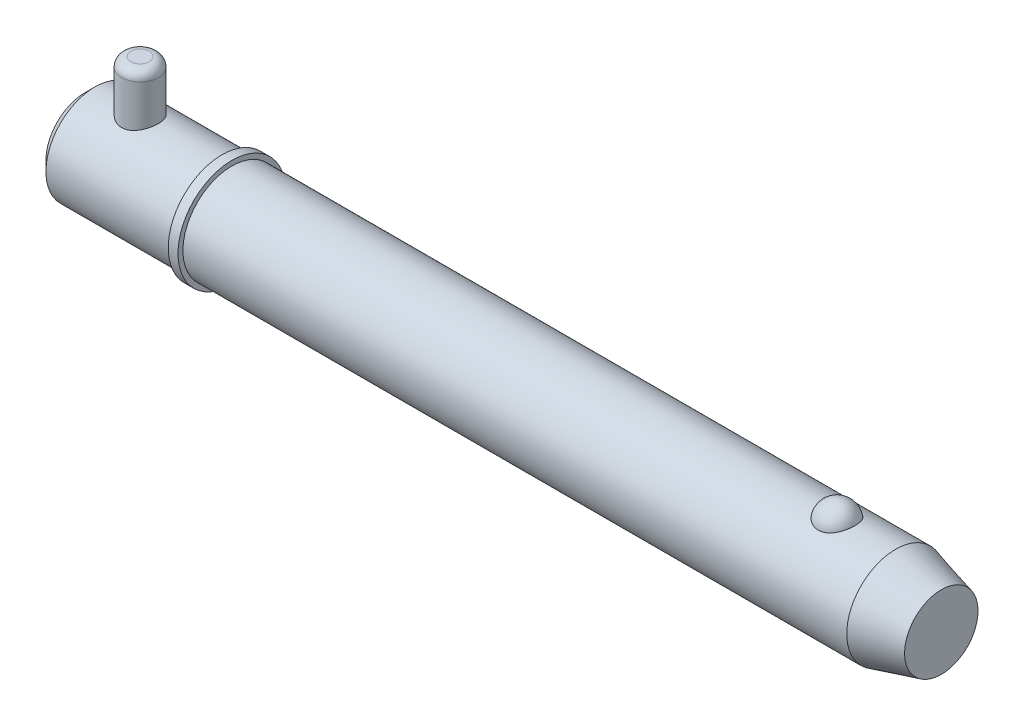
ISO-10303-21;
HEADER;
FILE_DESCRIPTION(('STEP AP214'),'2;1');
FILE_NAME('part.step','',(''),(''),'','','');
FILE_SCHEMA(('AUTOMOTIVE_DESIGN { 1 0 10303 214 1 1 1 1 }'));
ENDSEC;
DATA;
#1=APPLICATION_CONTEXT('core data for automotive mechanical design processes');
#2=APPLICATION_PROTOCOL_DEFINITION('international standard','automotive_design',2000,#1);
#3=PRODUCT_CONTEXT('',#1,'mechanical');
#4=PRODUCT('Part','Part','',(#3));
#5=PRODUCT_RELATED_PRODUCT_CATEGORY('part','',(#4));
#6=PRODUCT_DEFINITION_FORMATION('','',#4);
#7=PRODUCT_DEFINITION_CONTEXT('part definition',#1,'design');
#8=PRODUCT_DEFINITION('design','',#6,#7);
#9=PRODUCT_DEFINITION_SHAPE('','',#8);
#10=(LENGTH_UNIT() NAMED_UNIT(*) SI_UNIT(.MILLI.,.METRE.));
#11=(NAMED_UNIT(*) PLANE_ANGLE_UNIT() SI_UNIT($,.RADIAN.));
#12=(NAMED_UNIT(*) SI_UNIT($,.STERADIAN.) SOLID_ANGLE_UNIT());
#13=UNCERTAINTY_MEASURE_WITH_UNIT(LENGTH_MEASURE(1.E-05),#10,'distance_accuracy_value','');
#14=(GEOMETRIC_REPRESENTATION_CONTEXT(3) GLOBAL_UNCERTAINTY_ASSIGNED_CONTEXT((#13)) GLOBAL_UNIT_ASSIGNED_CONTEXT((#10,
#11,#12)) REPRESENTATION_CONTEXT('',''));
#15=CARTESIAN_POINT('',(0.,0.,0.));
#16=DIRECTION('',(0.,0.,1.));
#17=DIRECTION('',(1.,0.,0.));
#18=AXIS2_PLACEMENT_3D('',#15,#16,#17);
#19=CARTESIAN_POINT('',(14.28,25.4,0.));
#20=DIRECTION('',(0.,-1.,0.));
#21=DIRECTION('',(0.,0.,-1.));
#22=AXIS2_PLACEMENT_3D('',#19,#20,#21);
#23=CYLINDRICAL_SURFACE('',#22,4.76);
#24=CARTESIAN_POINT('',(14.28,-10.32,0.));
#25=DIRECTION('',(0.,1.,0.));
#26=DIRECTION('',(0.,0.,1.));
#27=AXIS2_PLACEMENT_3D('',#24,#25,#26);
#28=CIRCLE('',#27,4.76);
#29=CARTESIAN_POINT('',(14.28,-10.32,-4.76));
#30=VERTEX_POINT('',#29);
#31=EDGE_CURVE('P0_E25',#30,#30,#28,.T.);
#32=CARTESIAN_POINT('',(14.28,23.02,0.));
#33=DIRECTION('',(0.,1.,0.));
#34=DIRECTION('',(0.,0.,1.));
#35=AXIS2_PLACEMENT_3D('',#32,#33,#34);
#36=CIRCLE('',#35,4.76);
#37=CARTESIAN_POINT('',(14.28,23.02,-4.76));
#38=VERTEX_POINT('',#37);
#39=EDGE_CURVE('P0_E29',#38,#38,#36,.F.);
#40=CARTESIAN_POINT('',(14.28,-10.32,-4.76));
#41=CARTESIAN_POINT('',(14.28,-9.97270833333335,-4.76));
#42=CARTESIAN_POINT('',(14.28,-9.62541666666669,-4.76));
#43=CARTESIAN_POINT('',(14.28,-8.93083333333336,-4.76));
#44=CARTESIAN_POINT('',(14.28,-8.58354166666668,-4.76));
#45=CARTESIAN_POINT('',(14.28,-7.88895833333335,-4.76));
#46=CARTESIAN_POINT('',(14.28,-7.54166666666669,-4.76));
#47=CARTESIAN_POINT('',(14.28,-6.84708333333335,-4.76));
#48=CARTESIAN_POINT('',(14.28,-6.49979166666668,-4.76));
#49=CARTESIAN_POINT('',(14.28,-5.80520833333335,-4.76));
#50=CARTESIAN_POINT('',(14.28,-5.45791666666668,-4.76));
#51=CARTESIAN_POINT('',(14.28,-4.76333333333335,-4.76));
#52=CARTESIAN_POINT('',(14.28,-4.41604166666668,-4.76));
#53=CARTESIAN_POINT('',(14.28,-3.72145833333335,-4.76));
#54=CARTESIAN_POINT('',(14.28,-3.37416666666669,-4.76));
#55=CARTESIAN_POINT('',(14.28,-2.67958333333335,-4.76));
#56=CARTESIAN_POINT('',(14.28,-2.33229166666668,-4.76));
#57=CARTESIAN_POINT('',(14.28,-1.63770833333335,-4.76));
#58=CARTESIAN_POINT('',(14.28,-1.29041666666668,-4.76));
#59=CARTESIAN_POINT('',(14.28,-0.595833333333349,-4.76));
#60=CARTESIAN_POINT('',(14.28,-0.24854166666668,-4.76));
#61=CARTESIAN_POINT('',(14.28,0.446041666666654,-4.76));
#62=CARTESIAN_POINT('',(14.28,0.793333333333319,-4.76));
#63=CARTESIAN_POINT('',(14.28,1.48791666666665,-4.76));
#64=CARTESIAN_POINT('',(14.28,1.83520833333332,-4.76));
#65=CARTESIAN_POINT('',(14.28,2.52979166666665,-4.76));
#66=CARTESIAN_POINT('',(14.28,2.87708333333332,-4.76));
#67=CARTESIAN_POINT('',(14.28,3.57166666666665,-4.76));
#68=CARTESIAN_POINT('',(14.28,3.91895833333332,-4.76));
#69=CARTESIAN_POINT('',(14.28,4.61354166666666,-4.76));
#70=CARTESIAN_POINT('',(14.28,4.96083333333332,-4.76));
#71=CARTESIAN_POINT('',(14.28,5.65541666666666,-4.76));
#72=CARTESIAN_POINT('',(14.28,6.00270833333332,-4.76));
#73=CARTESIAN_POINT('',(14.28,6.69729166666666,-4.76));
#74=CARTESIAN_POINT('',(14.28,7.04458333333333,-4.76));
#75=CARTESIAN_POINT('',(14.28,7.73916666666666,-4.76));
#76=CARTESIAN_POINT('',(14.28,8.08645833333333,-4.76));
#77=CARTESIAN_POINT('',(14.28,8.78104166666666,-4.76));
#78=CARTESIAN_POINT('',(14.28,9.12833333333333,-4.76));
#79=CARTESIAN_POINT('',(14.28,9.82291666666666,-4.76));
#80=CARTESIAN_POINT('',(14.28,10.1702083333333,-4.76));
#81=CARTESIAN_POINT('',(14.28,10.8647916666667,-4.76));
#82=CARTESIAN_POINT('',(14.28,11.2120833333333,-4.76));
#83=CARTESIAN_POINT('',(14.28,11.9066666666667,-4.76));
#84=CARTESIAN_POINT('',(14.28,12.2539583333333,-4.76));
#85=CARTESIAN_POINT('',(14.28,12.9485416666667,-4.76));
#86=CARTESIAN_POINT('',(14.28,13.2958333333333,-4.76));
#87=CARTESIAN_POINT('',(14.28,13.9904166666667,-4.76));
#88=CARTESIAN_POINT('',(14.28,14.3377083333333,-4.76));
#89=CARTESIAN_POINT('',(14.28,15.0322916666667,-4.76));
#90=CARTESIAN_POINT('',(14.28,15.3795833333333,-4.76));
#91=CARTESIAN_POINT('',(14.28,16.0741666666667,-4.76));
#92=CARTESIAN_POINT('',(14.28,16.4214583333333,-4.76));
#93=CARTESIAN_POINT('',(14.28,17.1160416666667,-4.76));
#94=CARTESIAN_POINT('',(14.28,17.4633333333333,-4.76));
#95=CARTESIAN_POINT('',(14.28,18.1579166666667,-4.76));
#96=CARTESIAN_POINT('',(14.28,18.5052083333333,-4.76));
#97=CARTESIAN_POINT('',(14.28,19.1997916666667,-4.76));
#98=CARTESIAN_POINT('',(14.28,19.5470833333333,-4.76));
#99=CARTESIAN_POINT('',(14.28,20.2416666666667,-4.76));
#100=CARTESIAN_POINT('',(14.28,20.5889583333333,-4.76));
#101=CARTESIAN_POINT('',(14.28,21.2835416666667,-4.76));
#102=CARTESIAN_POINT('',(14.28,21.6308333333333,-4.76));
#103=CARTESIAN_POINT('',(14.28,22.3254166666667,-4.76));
#104=CARTESIAN_POINT('',(14.28,22.6727083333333,-4.76));
#105=CARTESIAN_POINT('',(14.28,23.02,-4.76));
#106=B_SPLINE_CURVE_WITH_KNOTS('',3,(#40,#41,#42,#43,#44,#45,#46,#47,#48,#49,#50,#51,#52,#53,
#54,#55,#56,#57,#58,#59,#60,#61,#62,#63,#64,#65,#66,#67,#68,#69,#70,#71,#72,#73,#74,#75,#76,#77,
#78,#79,#80,#81,#82,#83,#84,#85,#86,#87,#88,#89,#90,#91,#92,#93,#94,#95,#96,#97,#98,#99,#100,
#101,#102,#103,#104,#105),.UNSPECIFIED.,.F.,.F.,(4,2,2,2,2,2,2,2,2,2,2,2,2,2,2,2,2,2,2,2,2,2,2,
2,2,2,2,2,2,2,2,2,4),(0.,1.041875,2.08375,3.125625,4.1675,5.209375,6.25125,7.293125,
8.33500000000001,9.376875,10.41875,11.460625,12.5025,13.544375,14.58625,15.628125,16.67,
17.711875,18.75375,19.795625,20.8375,21.879375,22.92125,23.963125,25.005,26.046875,27.08875,
28.130625,29.1725,30.214375,31.25625,32.298125,33.34),.UNSPECIFIED.);
#107=EDGE_CURVE('P0_BSEAM14',#30,#38,#106,.T.);
#108=ORIENTED_EDGE('',*,*,#31,.T.);
#109=ORIENTED_EDGE('',*,*,#39,.T.);
#110=ORIENTED_EDGE('',*,*,#107,.T.);
#111=ORIENTED_EDGE('',*,*,#107,.F.);
#112=EDGE_LOOP('',(#108,#110,#109,#111));
#113=FACE_BOUND('',#112,.T.);
#114=ADVANCED_FACE('P0_F14',(#113),#23,.T.);
#115=CARTESIAN_POINT('',(14.28,25.4,0.));
#116=DIRECTION('',(0.,1.,0.));
#117=DIRECTION('',(0.,0.,1.));
#118=AXIS2_PLACEMENT_3D('',#115,#116,#117);
#119=PLANE('',#118);
#120=CARTESIAN_POINT('',(14.28,25.4,0.));
#121=DIRECTION('',(0.,1.,0.));
#122=DIRECTION('',(0.,0.,1.));
#123=AXIS2_PLACEMENT_3D('',#120,#121,#122);
#124=CIRCLE('',#123,2.38);
#125=CARTESIAN_POINT('',(14.28,25.4,2.38));
#126=VERTEX_POINT('',#125);
#127=EDGE_CURVE('P0_E10',#126,#126,#124,.T.);
#128=ORIENTED_EDGE('',*,*,#127,.T.);
#129=EDGE_LOOP('',(#128));
#130=FACE_BOUND('',#129,.T.);
#131=ADVANCED_FACE('P0_F46',(#130),#119,.T.);
#132=CARTESIAN_POINT('',(14.28,-12.7,0.));
#133=DIRECTION('',(0.,1.,0.));
#134=DIRECTION('',(0.,0.,1.));
#135=AXIS2_PLACEMENT_3D('',#132,#133,#134);
#136=PLANE('',#135);
#137=CARTESIAN_POINT('',(14.28,-12.7,0.));
#138=DIRECTION('',(0.,1.,0.));
#139=DIRECTION('',(0.,0.,1.));
#140=AXIS2_PLACEMENT_3D('',#137,#138,#139);
#141=CIRCLE('',#140,2.38);
#142=CARTESIAN_POINT('',(14.28,-12.7,2.38));
#143=VERTEX_POINT('',#142);
#144=EDGE_CURVE('P0_E21',#143,#143,#141,.F.);
#145=ORIENTED_EDGE('',*,*,#144,.T.);
#146=EDGE_LOOP('',(#145));
#147=FACE_BOUND('',#146,.T.);
#148=ADVANCED_FACE('P0_F43',(#147),#136,.F.);
#149=CARTESIAN_POINT('',(14.28,-10.32,0.));
#150=DIRECTION('',(0.,1.,0.));
#151=DIRECTION('',(0.,0.,1.));
#152=AXIS2_PLACEMENT_3D('',#149,#150,#151);
#153=DEGENERATE_TOROIDAL_SURFACE('',#152,2.38,2.38,.T.);
#154=ORIENTED_EDGE('',*,*,#144,.F.);
#155=EDGE_LOOP('',(#154));
#156=FACE_BOUND('',#155,.T.);
#157=ORIENTED_EDGE('',*,*,#31,.F.);
#158=EDGE_LOOP('',(#157));
#159=FACE_BOUND('',#158,.T.);
#160=ADVANCED_FACE('P0_F38',(#156,#159),#153,.T.);
#161=CARTESIAN_POINT('',(14.28,23.02,0.));
#162=DIRECTION('',(0.,1.,0.));
#163=DIRECTION('',(0.,0.,1.));
#164=AXIS2_PLACEMENT_3D('',#161,#162,#163);
#165=DEGENERATE_TOROIDAL_SURFACE('',#164,2.38,2.38,.T.);
#166=ORIENTED_EDGE('',*,*,#39,.F.);
#167=EDGE_LOOP('',(#166));
#168=FACE_BOUND('',#167,.T.);
#169=ORIENTED_EDGE('',*,*,#127,.F.);
#170=EDGE_LOOP('',(#169));
#171=FACE_BOUND('',#170,.T.);
#172=ADVANCED_FACE('P0_F16',(#168,#171),#165,.T.);
#173=CLOSED_SHELL('',(#114,#131,#148,#160,#172));
#174=MANIFOLD_SOLID_BREP('P0_B1',#173);
#175=CARTESIAN_POINT('',(0.,0.,0.));
#176=DIRECTION('',(1.,0.,0.));
#177=DIRECTION('',(0.,0.,-1.));
#178=AXIS2_PLACEMENT_3D('',#175,#176,#177);
#179=CYLINDRICAL_SURFACE('',#178,12.7);
#180=CARTESIAN_POINT('',(210.400738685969,0.,0.));
#181=DIRECTION('',(1.,0.,0.));
#182=DIRECTION('',(0.,0.,-1.));
#183=AXIS2_PLACEMENT_3D('',#180,#181,#182);
#184=CIRCLE('',#183,12.7);
#185=CARTESIAN_POINT('',(210.400738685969,0.,-12.7));
#186=VERTEX_POINT('',#185);
#187=EDGE_CURVE('P1_E81',#186,#186,#184,.T.);
#188=ORIENTED_EDGE('',*,*,#187,.F.);
#189=EDGE_LOOP('',(#188));
#190=FACE_BOUND('',#189,.T.);
#191=CARTESIAN_POINT('',(38.1,0.,0.));
#192=DIRECTION('',(1.,0.,0.));
#193=DIRECTION('',(0.,0.,-1.));
#194=AXIS2_PLACEMENT_3D('',#191,#192,#193);
#195=CIRCLE('',#194,12.7);
#196=CARTESIAN_POINT('',(38.1,0.,-12.7));
#197=VERTEX_POINT('',#196);
#198=EDGE_CURVE('P1_E85',#197,#197,#195,.T.);
#199=ORIENTED_EDGE('',*,*,#198,.T.);
#200=EDGE_LOOP('',(#199));
#201=FACE_BOUND('',#200,.T.);
#202=CARTESIAN_POINT('',(195.160042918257,11.7500437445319,4.81938502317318));
#203=CARTESIAN_POINT('',(195.035088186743,11.7500430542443,4.81938571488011));
#204=CARTESIAN_POINT('',(194.910144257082,11.7520975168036,4.81438658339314));
#205=CARTESIAN_POINT('',(194.661142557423,11.760253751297,4.79442904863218));
#206=CARTESIAN_POINT('',(194.537085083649,11.7663568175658,4.77946746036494));
#207=CARTESIAN_POINT('',(194.290901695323,11.7824262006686,4.7397141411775));
#208=CARTESIAN_POINT('',(194.168774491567,11.7923898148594,4.71492928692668));
#209=CARTESIAN_POINT('',(193.927187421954,11.8158938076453,4.65571340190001));
#210=CARTESIAN_POINT('',(193.80772859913,11.8294355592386,4.6212786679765));
#211=CARTESIAN_POINT('',(193.572557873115,11.8596812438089,4.54309502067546));
#212=CARTESIAN_POINT('',(193.456839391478,11.8763792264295,4.49936361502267));
#213=CARTESIAN_POINT('',(193.229653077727,11.9124878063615,4.40287235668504));
#214=CARTESIAN_POINT('',(193.118186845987,11.9318994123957,4.35010914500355));
#215=CARTESIAN_POINT('',(192.791278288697,11.9934256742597,4.17881316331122));
#216=CARTESIAN_POINT('',(192.583127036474,12.038858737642,4.04720756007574));
#217=CARTESIAN_POINT('',(192.185850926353,12.1352173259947,3.748564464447));
#218=CARTESIAN_POINT('',(191.997443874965,12.1862630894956,3.58061821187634));
#219=CARTESIAN_POINT('',(191.650521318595,12.2875163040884,3.21600758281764));
#220=CARTESIAN_POINT('',(191.492011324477,12.3377235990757,3.0193379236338));
#221=CARTESIAN_POINT('',(191.20168878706,12.4344923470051,2.592916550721));
#222=CARTESIAN_POINT('',(191.071376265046,12.4807925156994,2.36208286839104));
#223=CARTESIAN_POINT('',(190.849407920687,12.5623454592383,1.88070399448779));
#224=CARTESIAN_POINT('',(190.757755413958,12.5975972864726,1.63015711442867));
#225=CARTESIAN_POINT('',(190.614046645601,12.6538414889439,1.1129886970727));
#226=CARTESIAN_POINT('',(190.562499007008,12.6746503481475,0.846205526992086));
#227=CARTESIAN_POINT('',(190.501977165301,12.699153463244,0.307085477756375));
#228=CARTESIAN_POINT('',(190.493001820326,12.7028481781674,0.034748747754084));
#229=CARTESIAN_POINT('',(190.517731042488,12.6927785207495,-0.506073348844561));
#230=CARTESIAN_POINT('',(190.551189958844,12.6791146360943,-0.774571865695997));
#231=CARTESIAN_POINT('',(190.659687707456,12.635882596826,-1.30170246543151));
#232=CARTESIAN_POINT('',(190.73472729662,12.606314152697,-1.56033436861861));
#233=CARTESIAN_POINT('',(190.925000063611,12.5342328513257,-2.0608389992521));
#234=CARTESIAN_POINT('',(191.040287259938,12.4917026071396,-2.30268867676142));
#235=CARTESIAN_POINT('',(191.308704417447,12.3981123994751,-2.76259600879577));
#236=CARTESIAN_POINT('',(191.461837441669,12.3470517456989,-2.98065173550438));
#237=CARTESIAN_POINT('',(191.803507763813,12.2416045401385,-3.38786328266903));
#238=CARTESIAN_POINT('',(191.992201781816,12.1872040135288,-3.57688418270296));
#239=CARTESIAN_POINT('',(192.400239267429,12.0814086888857,-3.91941073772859));
#240=CARTESIAN_POINT('',(192.619580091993,12.0300136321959,-4.07291945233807));
#241=CARTESIAN_POINT('',(193.078375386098,11.9373542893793,-4.33691289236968));
#242=CARTESIAN_POINT('',(193.317304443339,11.8958982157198,-4.44824125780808));
#243=CARTESIAN_POINT('',(193.81243761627,11.8268116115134,-4.62881985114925));
#244=CARTESIAN_POINT('',(194.068635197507,11.7991758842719,-4.69808589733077));
#245=CARTESIAN_POINT('',(194.577164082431,11.7622209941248,-4.78983181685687));
#246=CARTESIAN_POINT('',(194.829041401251,11.7520502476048,-4.81449025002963));
#247=CARTESIAN_POINT('',(195.333573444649,11.7485796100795,-4.82295735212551));
#248=CARTESIAN_POINT('',(195.586228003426,11.7552763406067,-4.80677420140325));
#249=CARTESIAN_POINT('',(196.076834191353,11.7842584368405,-4.73525430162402));
#250=CARTESIAN_POINT('',(196.314998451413,11.8060486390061,-4.68116061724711));
#251=CARTESIAN_POINT('',(196.778489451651,11.8622750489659,-4.53678133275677));
#252=CARTESIAN_POINT('',(197.003815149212,11.8967122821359,-4.44649279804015));
#253=CARTESIAN_POINT('',(197.440801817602,11.9754603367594,-4.2298761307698));
#254=CARTESIAN_POINT('',(197.652057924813,12.0199699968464,-4.10280539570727));
#255=CARTESIAN_POINT('',(198.050601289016,12.1138028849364,-3.81685409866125));
#256=CARTESIAN_POINT('',(198.237883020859,12.163127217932,-3.65796622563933));
#257=CARTESIAN_POINT('',(198.593350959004,12.2642343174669,-3.30364864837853));
#258=CARTESIAN_POINT('',(198.760111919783,12.3160165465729,-3.10678783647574));
#259=CARTESIAN_POINT('',(199.059579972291,12.4142566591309,-2.68748409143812));
#260=CARTESIAN_POINT('',(199.192280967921,12.4607135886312,-2.4650365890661));
#261=CARTESIAN_POINT('',(199.424691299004,12.5450236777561,-1.9928951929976));
#262=CARTESIAN_POINT('',(199.523215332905,12.5825557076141,-1.74255918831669));
#263=CARTESIAN_POINT('',(199.679227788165,12.6431720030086,-1.22773734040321));
#264=CARTESIAN_POINT('',(199.736715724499,12.6662560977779,-0.963251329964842));
#265=CARTESIAN_POINT('',(199.809544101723,12.6956486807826,-0.4273550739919));
#266=CARTESIAN_POINT('',(199.824837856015,12.7019385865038,-0.155937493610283));
#267=CARTESIAN_POINT('',(199.812779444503,12.6970201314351,0.385928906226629));
#268=CARTESIAN_POINT('',(199.78542805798,12.6858120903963,0.656377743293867));
#269=CARTESIAN_POINT('',(199.713060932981,12.6568455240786,1.05454017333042));
#270=CARTESIAN_POINT('',(199.683796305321,12.6451962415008,1.18577850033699));
#271=CARTESIAN_POINT('',(199.615022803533,12.6181819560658,1.4451380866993));
#272=CARTESIAN_POINT('',(199.575517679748,12.6028183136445,1.57326046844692));
#273=CARTESIAN_POINT('',(199.486439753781,12.5687547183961,1.82554978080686));
#274=CARTESIAN_POINT('',(199.436862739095,12.5500533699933,1.9497150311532));
#275=CARTESIAN_POINT('',(199.32792115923,12.5098093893,2.19314370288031));
#276=CARTESIAN_POINT('',(199.268560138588,12.4882677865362,2.31240887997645));
#277=CARTESIAN_POINT('',(199.13997128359,12.4427679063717,2.5459303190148));
#278=CARTESIAN_POINT('',(199.070688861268,12.4187964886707,2.66015396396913));
#279=CARTESIAN_POINT('',(198.922903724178,12.3691892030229,2.88202659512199));
#280=CARTESIAN_POINT('',(198.844404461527,12.3435539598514,2.98967802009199));
#281=CARTESIAN_POINT('',(198.678550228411,12.2912955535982,3.1977438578));
#282=CARTESIAN_POINT('',(198.591191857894,12.2646720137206,3.298155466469));
#283=CARTESIAN_POINT('',(198.408161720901,12.2111945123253,3.49095035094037));
#284=CARTESIAN_POINT('',(198.312493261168,12.1843406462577,3.58333679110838));
#285=CARTESIAN_POINT('',(198.113627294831,12.1312249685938,3.75922876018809));
#286=CARTESIAN_POINT('',(198.010450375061,12.104961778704,3.84275713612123));
#287=CARTESIAN_POINT('',(197.79701336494,12.0537284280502,4.00056406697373));
#288=CARTESIAN_POINT('',(197.686756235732,12.028757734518,4.07484645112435));
#289=CARTESIAN_POINT('',(197.459755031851,11.9808306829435,4.21367959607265));
#290=CARTESIAN_POINT('',(197.343006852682,11.9578756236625,4.27822410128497));
#291=CARTESIAN_POINT('',(197.10394258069,11.9147184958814,4.39698483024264));
#292=CARTESIAN_POINT('',(196.981628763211,11.894515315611,4.45120522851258));
#293=CARTESIAN_POINT('',(196.722952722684,11.8561129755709,4.55255353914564));
#294=CARTESIAN_POINT('',(196.586223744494,11.8381764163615,4.59884858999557));
#295=CARTESIAN_POINT('',(196.308608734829,11.8069093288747,4.67853897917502));
#296=CARTESIAN_POINT('',(196.167724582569,11.7935767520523,4.71194005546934));
#297=CARTESIAN_POINT('',(195.88309446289,11.7720277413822,4.76552188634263));
#298=CARTESIAN_POINT('',(195.739348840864,11.7638106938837,4.78570422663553));
#299=CARTESIAN_POINT('',(195.450411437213,11.7528195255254,4.81263433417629));
#300=CARTESIAN_POINT('',(195.305219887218,11.7500445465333,4.81938421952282));
#301=CARTESIAN_POINT('',(195.160042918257,11.7500437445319,4.81938502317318));
#302=B_SPLINE_CURVE_WITH_KNOTS('',3,(#202,#203,#204,#205,#206,#207,#208,#209,#210,#211,#212,
#213,#214,#215,#216,#217,#218,#219,#220,#221,#222,#223,#224,#225,#226,#227,#228,#229,#230,#231,
#232,#233,#234,#235,#236,#237,#238,#239,#240,#241,#242,#243,#244,#245,#246,#247,#248,#249,#250,
#251,#252,#253,#254,#255,#256,#257,#258,#259,#260,#261,#262,#263,#264,#265,#266,#267,#268,#269,
#270,#271,#272,#273,#274,#275,#276,#277,#278,#279,#280,#281,#282,#283,#284,#285,#286,#287,#288,
#289,#290,#291,#292,#293,#294,#295,#296,#297,#298,#299,#300,#301),.UNSPECIFIED.,.T.,.F.,(4,2,2,
2,2,2,2,2,2,2,2,2,2,2,2,2,2,2,2,2,2,2,2,2,2,2,2,2,2,2,2,2,2,2,2,2,2,2,2,2,2,2,2,2,2,2,2,2,2,4),
(0.,0.374729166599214,0.749578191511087,1.12416526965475,1.49889629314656,1.87292776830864,
2.24709865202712,2.99481328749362,3.76399449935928,4.53331735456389,5.3368391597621,
6.14042986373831,6.95405296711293,7.76765424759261,8.57656703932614,9.38549455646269,
10.1955119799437,11.0055949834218,11.8193353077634,12.6330054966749,13.4294141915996,
14.2255231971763,14.9815786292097,15.7374826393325,16.4696948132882,17.2019663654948,
17.9501979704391,18.6986017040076,19.4844704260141,20.2704797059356,21.0815215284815,
21.8925729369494,22.7045213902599,23.5164550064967,23.9209608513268,24.3253187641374,
24.7298461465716,25.1342272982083,25.54092555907,25.947471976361,26.3541750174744,
26.7607169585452,27.1661834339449,27.5714814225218,27.9770386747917,28.3824315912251,
28.818120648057,29.2536155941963,29.6890582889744,30.1244323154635),.UNSPECIFIED.);
#303=CARTESIAN_POINT('',(195.160042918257,11.7500437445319,4.81938502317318));
#304=VERTEX_POINT('',#303);
#305=EDGE_CURVE('P1_E35',#304,#304,#302,.T.);
#306=ORIENTED_EDGE('',*,*,#305,.T.);
#307=EDGE_LOOP('',(#306));
#308=FACE_BOUND('',#307,.T.);
#309=ADVANCED_FACE('P1_F13',(#190,#201,#308),#179,.T.);
#310=CARTESIAN_POINT('',(0.,0.,0.));
#311=DIRECTION('',(-1.,0.,0.));
#312=DIRECTION('',(0.,0.,1.));
#313=AXIS2_PLACEMENT_3D('',#310,#311,#312);
#314=PLANE('',#313);
#315=CARTESIAN_POINT('',(0.,0.,0.));
#316=DIRECTION('',(1.,0.,0.));
#317=DIRECTION('',(0.,0.,-1.));
#318=AXIS2_PLACEMENT_3D('',#315,#316,#317);
#319=CIRCLE('',#318,10.16);
#320=CARTESIAN_POINT('',(0.,0.,-10.16));
#321=VERTEX_POINT('',#320);
#322=EDGE_CURVE('P1_E9',#321,#321,#319,.T.);
#323=ORIENTED_EDGE('',*,*,#322,.F.);
#324=EDGE_LOOP('',(#323));
#325=FACE_BOUND('',#324,.T.);
#326=ADVANCED_FACE('P1_F15',(#325),#314,.T.);
#327=CARTESIAN_POINT('',(2.53999999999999,0.,0.));
#328=DIRECTION('',(1.,0.,0.));
#329=DIRECTION('',(0.,0.,-1.));
#330=AXIS2_PLACEMENT_3D('',#327,#328,#329);
#331=CONICAL_SURFACE('',#330,12.7,0.78539816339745);
#332=ORIENTED_EDGE('',*,*,#322,.T.);
#333=EDGE_LOOP('',(#332));
#334=FACE_BOUND('',#333,.T.);
#335=CARTESIAN_POINT('',(2.53999999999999,0.,0.));
#336=DIRECTION('',(1.,0.,0.));
#337=DIRECTION('',(0.,0.,-1.));
#338=AXIS2_PLACEMENT_3D('',#335,#336,#337);
#339=CIRCLE('',#338,12.7);
#340=CARTESIAN_POINT('',(2.53999999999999,0.,-12.7));
#341=VERTEX_POINT('',#340);
#342=EDGE_CURVE('P1_E26',#341,#341,#339,.T.);
#343=ORIENTED_EDGE('',*,*,#342,.F.);
#344=EDGE_LOOP('',(#343));
#345=FACE_BOUND('',#344,.T.);
#346=ADVANCED_FACE('P1_F77',(#334,#345),#331,.T.);
#347=CARTESIAN_POINT('',(0.,0.,0.));
#348=DIRECTION('',(1.,0.,0.));
#349=DIRECTION('',(0.,0.,-1.));
#350=AXIS2_PLACEMENT_3D('',#347,#348,#349);
#351=CYLINDRICAL_SURFACE('',#350,12.7);
#352=CARTESIAN_POINT('',(14.28,-11.7742260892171,4.76));
#353=CARTESIAN_POINT('',(14.1514948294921,-11.7742255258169,4.76000061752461));
#354=CARTESIAN_POINT('',(14.0229980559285,-11.7763355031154,4.75479194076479));
#355=CARTESIAN_POINT('',(13.7669369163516,-11.7847043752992,4.73401198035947));
#356=CARTESIAN_POINT('',(13.6393728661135,-11.7909646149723,4.71843733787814));
#357=CARTESIAN_POINT('',(13.386226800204,-11.8074248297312,4.67709434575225));
#358=CARTESIAN_POINT('',(13.2606439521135,-11.8176231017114,4.65133040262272));
#359=CARTESIAN_POINT('',(13.0122434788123,-11.8416347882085,4.58985545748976));
#360=CARTESIAN_POINT('',(12.8894269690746,-11.8554496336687,4.55414051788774));
#361=CARTESIAN_POINT('',(12.6477622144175,-11.8862222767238,4.47320764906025));
#362=CARTESIAN_POINT('',(12.5289037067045,-11.9031710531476,4.4280169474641));
#363=CARTESIAN_POINT('',(12.2955059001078,-11.939736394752,4.32845291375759));
#364=CARTESIAN_POINT('',(12.1809682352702,-11.9593539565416,4.2740761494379));
#365=CARTESIAN_POINT('',(11.8448901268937,-12.0213893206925,4.09777237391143));
#366=CARTESIAN_POINT('',(11.6307077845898,-12.0670135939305,3.9626122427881));
#367=CARTESIAN_POINT('',(11.2179129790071,-12.1641514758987,3.65386230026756));
#368=CARTESIAN_POINT('',(11.0204399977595,-12.2158379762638,3.47881300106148));
#369=CARTESIAN_POINT('',(10.6568212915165,-12.3178468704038,3.09829182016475));
#370=CARTESIAN_POINT('',(10.4906822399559,-12.3681689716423,2.89281347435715));
#371=CARTESIAN_POINT('',(10.1890299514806,-12.4638367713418,2.44867909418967));
#372=CARTESIAN_POINT('',(10.054749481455,-12.5089552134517,2.20913281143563));
#373=CARTESIAN_POINT('',(9.82886079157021,-12.5870472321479,1.70885919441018));
#374=CARTESIAN_POINT('',(9.73723778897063,-12.620025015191,1.44813923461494));
#375=CARTESIAN_POINT('',(9.60324488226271,-12.6688874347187,0.9248423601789));
#376=CARTESIAN_POINT('',(9.55892269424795,-12.6854474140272,0.662829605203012));
#377=CARTESIAN_POINT('',(9.5145335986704,-12.7020320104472,0.134596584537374));
#378=CARTESIAN_POINT('',(9.5144523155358,-12.7020619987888,-0.131622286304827));
#379=CARTESIAN_POINT('',(9.55741019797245,-12.6860129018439,-0.646717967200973));
#380=CARTESIAN_POINT('',(9.59831845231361,-12.6707298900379,-0.895801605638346));
#381=CARTESIAN_POINT('',(9.71850987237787,-12.6268158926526,-1.38327219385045));
#382=CARTESIAN_POINT('',(9.79779575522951,-12.5981839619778,-1.62165838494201));
#383=CARTESIAN_POINT('',(9.99348296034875,-12.5298894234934,-2.08508424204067));
#384=CARTESIAN_POINT('',(10.110407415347,-12.4900724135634,-2.30987931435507));
#385=CARTESIAN_POINT('',(10.3775896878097,-12.4034373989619,-2.7372158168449));
#386=CARTESIAN_POINT('',(10.5278582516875,-12.3566171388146,-2.93975004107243));
#387=CARTESIAN_POINT('',(10.8677318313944,-12.257571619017,-3.32936830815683));
#388=CARTESIAN_POINT('',(11.0591227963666,-12.2051903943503,-3.51485714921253));
#389=CARTESIAN_POINT('',(11.4706087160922,-12.1031155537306,-3.85170663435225));
#390=CARTESIAN_POINT('',(11.6907108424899,-12.0534226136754,-4.00305872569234));
#391=CARTESIAN_POINT('',(12.1596597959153,-11.9613684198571,-4.27038218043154));
#392=CARTESIAN_POINT('',(12.4090353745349,-11.9191939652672,-4.38549550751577));
#393=CARTESIAN_POINT('',(12.9256290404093,-11.8491124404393,-4.57149117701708));
#394=CARTESIAN_POINT('',(13.1928371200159,-11.8211974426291,-4.64239810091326));
#395=CARTESIAN_POINT('',(13.7217488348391,-11.7846654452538,-4.73434137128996));
#396=CARTESIAN_POINT('',(13.9829438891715,-11.7750694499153,-4.75791141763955));
#397=CARTESIAN_POINT('',(14.5056760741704,-11.7734909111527,-4.76182097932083));
#398=CARTESIAN_POINT('',(14.7672131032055,-11.7815039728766,-4.74217128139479));
#399=CARTESIAN_POINT('',(15.2702140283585,-11.8132466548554,-4.66249544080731));
#400=CARTESIAN_POINT('',(15.5120417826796,-11.8362133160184,-4.60442726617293));
#401=CARTESIAN_POINT('',(15.9824097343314,-11.8943704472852,-4.45202868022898));
#402=CARTESIAN_POINT('',(16.2109472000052,-11.9295634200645,-4.35769084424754));
#403=CARTESIAN_POINT('',(16.6577741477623,-12.0098310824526,-4.13144368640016));
#404=CARTESIAN_POINT('',(16.8753590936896,-12.055226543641,-3.99825937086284));
#405=CARTESIAN_POINT('',(17.2859732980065,-12.150238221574,-3.69949845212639));
#406=CARTESIAN_POINT('',(17.4789935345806,-12.19985597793,-3.5339100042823));
#407=CARTESIAN_POINT('',(17.8477707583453,-12.3015434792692,-3.1624728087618));
#408=CARTESIAN_POINT('',(18.0216609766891,-12.3535695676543,-2.95473880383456));
#409=CARTESIAN_POINT('',(18.254545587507,-12.426745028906,-2.62277433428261));
#410=CARTESIAN_POINT('',(18.3275489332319,-12.4503382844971,-2.50865480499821));
#411=CARTESIAN_POINT('',(18.463723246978,-12.4952713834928,-2.27428971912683));
#412=CARTESIAN_POINT('',(18.5268984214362,-12.5166121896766,-2.15404681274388));
#413=CARTESIAN_POINT('',(18.6427140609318,-12.5563817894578,-1.90858448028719));
#414=CARTESIAN_POINT('',(18.6953855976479,-12.5748191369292,-1.78338108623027));
#415=CARTESIAN_POINT('',(18.7899337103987,-12.6083284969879,-1.52857834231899));
#416=CARTESIAN_POINT('',(18.8318147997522,-12.6234019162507,-1.39898085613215));
#417=CARTESIAN_POINT('',(18.9043819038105,-12.6497495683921,-1.13633254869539));
#418=CARTESIAN_POINT('',(18.9350698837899,-12.6610244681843,-1.00328233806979));
#419=CARTESIAN_POINT('',(18.9849303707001,-12.6794412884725,-0.734761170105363));
#420=CARTESIAN_POINT('',(19.0041035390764,-12.6865834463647,-0.59929035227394));
#421=CARTESIAN_POINT('',(19.0299427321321,-12.6962286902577,-0.335006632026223));
#422=CARTESIAN_POINT('',(19.0372742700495,-12.698978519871,-0.206267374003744));
#423=CARTESIAN_POINT('',(19.0414668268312,-12.7005496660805,0.0514515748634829));
#424=CARTESIAN_POINT('',(19.038324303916,-12.69936965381,0.180431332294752));
#425=CARTESIAN_POINT('',(19.0215965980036,-12.6931114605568,0.437551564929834));
#426=CARTESIAN_POINT('',(19.0080165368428,-12.6880351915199,0.565692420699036));
#427=CARTESIAN_POINT('',(18.9705519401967,-12.6741222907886,0.820297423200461));
#428=CARTESIAN_POINT('',(18.9466635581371,-12.665284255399,0.946760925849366));
#429=CARTESIAN_POINT('',(18.8895279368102,-12.6443449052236,1.19395899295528));
#430=CARTESIAN_POINT('',(18.8565273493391,-12.6323299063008,1.3147578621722));
#431=CARTESIAN_POINT('',(18.781239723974,-12.6052503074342,1.55308888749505));
#432=CARTESIAN_POINT('',(18.738949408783,-12.5901846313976,1.67061987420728));
#433=CARTESIAN_POINT('',(18.5986461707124,-12.5409473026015,2.01714406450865));
#434=CARTESIAN_POINT('',(18.4871532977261,-12.502717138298,2.24027279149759));
#435=CARTESIAN_POINT('',(18.2262440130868,-12.4173042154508,2.6742599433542));
#436=CARTESIAN_POINT('',(18.0754310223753,-12.3698127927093,2.88420891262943));
#437=CARTESIAN_POINT('',(17.7421836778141,-12.271667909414,3.27675114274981));
#438=CARTESIAN_POINT('',(17.5597380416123,-12.2210133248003,3.45933459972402));
#439=CARTESIAN_POINT('',(17.2605468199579,-12.1452079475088,3.7138066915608));
#440=CARTESIAN_POINT('',(17.1535518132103,-12.119328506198,3.79719993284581));
#441=CARTESIAN_POINT('',(16.9326449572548,-12.0688597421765,3.95467398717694));
#442=CARTESIAN_POINT('',(16.8187356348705,-12.0442699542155,4.02875817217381));
#443=CARTESIAN_POINT('',(16.5846234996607,-11.9971053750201,4.16711104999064));
#444=CARTESIAN_POINT('',(16.4644172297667,-11.9745317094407,4.23137427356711));
#445=CARTESIAN_POINT('',(16.2185866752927,-11.9321360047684,4.34949041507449));
#446=CARTESIAN_POINT('',(16.09296473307,-11.9123127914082,4.40334777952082));
#447=CARTESIAN_POINT('',(15.8314769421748,-11.875268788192,4.50232278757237));
#448=CARTESIAN_POINT('',(15.6954035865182,-11.8582009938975,4.54695127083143));
#449=CARTESIAN_POINT('',(15.4194002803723,-11.8284328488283,4.62383807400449));
#450=CARTESIAN_POINT('',(15.2794720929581,-11.815730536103,4.6561019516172));
#451=CARTESIAN_POINT('',(14.9969657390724,-11.7951940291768,4.70788444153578));
#452=CARTESIAN_POINT('',(14.8543884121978,-11.7873583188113,4.72740702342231));
#453=CARTESIAN_POINT('',(14.5678704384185,-11.7768749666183,4.75346370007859));
#454=CARTESIAN_POINT('',(14.4239299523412,-11.7742267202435,4.75999930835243));
#455=CARTESIAN_POINT('',(14.28,-11.7742260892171,4.76));
#456=B_SPLINE_CURVE_WITH_KNOTS('',3,(#352,#353,#354,#355,#356,#357,#358,#359,#360,#361,#362,
#363,#364,#365,#366,#367,#368,#369,#370,#371,#372,#373,#374,#375,#376,#377,#378,#379,#380,#381,
#382,#383,#384,#385,#386,#387,#388,#389,#390,#391,#392,#393,#394,#395,#396,#397,#398,#399,#400,
#401,#402,#403,#404,#405,#406,#407,#408,#409,#410,#411,#412,#413,#414,#415,#416,#417,#418,#419,
#420,#421,#422,#423,#424,#425,#426,#427,#428,#429,#430,#431,#432,#433,#434,#435,#436,#437,#438,
#439,#440,#441,#442,#443,#444,#445,#446,#447,#448,#449,#450,#451,#452,#453,#454,#455),
.UNSPECIFIED.,.T.,.F.,(4,2,2,2,2,2,2,2,2,2,2,2,2,2,2,2,2,2,2,2,2,2,2,2,2,2,2,2,2,2,2,2,2,2,2,2,
2,2,2,2,2,2,2,2,2,2,2,2,2,2,2,4),(0.,0.385378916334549,0.770882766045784,1.15622008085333,
1.54171009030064,1.92610725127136,2.31064835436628,3.07917291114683,3.88239385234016,
4.68578566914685,5.51648193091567,6.34689010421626,7.14151420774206,7.93588010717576,
8.69098665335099,9.44614666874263,10.2122918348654,10.9786842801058,11.789876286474,
12.6012713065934,13.4306405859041,14.2595482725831,15.0427613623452,15.8257790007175,
16.5716820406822,17.3177378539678,18.0917395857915,18.8660247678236,19.6893332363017,
20.1014571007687,20.5134040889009,20.9241137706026,21.3346513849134,21.7451168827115,
22.1555587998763,22.542011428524,22.928594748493,23.3149884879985,23.7015265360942,
24.0784835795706,24.4555738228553,25.2091300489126,25.994347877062,26.7798463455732,
27.1937428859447,27.6074890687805,28.0214648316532,28.4352633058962,28.8672794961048,
29.299101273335,29.7307884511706,30.1624253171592),.UNSPECIFIED.);
#457=CARTESIAN_POINT('',(14.28,-11.7742260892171,4.76));
#458=VERTEX_POINT('',#457);
#459=EDGE_CURVE('P1_E17',#458,#458,#456,.T.);
#460=ORIENTED_EDGE('',*,*,#459,.F.);
#461=EDGE_LOOP('',(#460));
#462=FACE_BOUND('',#461,.T.);
#463=CARTESIAN_POINT('',(14.28,11.7742260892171,4.76));
#464=CARTESIAN_POINT('',(14.4085051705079,11.7742255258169,4.76000061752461));
#465=CARTESIAN_POINT('',(14.5370019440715,11.7763355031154,4.75479194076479));
#466=CARTESIAN_POINT('',(14.7930630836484,11.7847043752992,4.73401198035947));
#467=CARTESIAN_POINT('',(14.9206271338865,11.7909646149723,4.71843733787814));
#468=CARTESIAN_POINT('',(15.173773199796,11.8074248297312,4.67709434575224));
#469=CARTESIAN_POINT('',(15.2993560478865,11.8176231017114,4.65133040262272));
#470=CARTESIAN_POINT('',(15.5477565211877,11.8416347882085,4.58985545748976));
#471=CARTESIAN_POINT('',(15.6705730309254,11.8554496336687,4.55414051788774));
#472=CARTESIAN_POINT('',(15.9122377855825,11.8862222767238,4.47320764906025));
#473=CARTESIAN_POINT('',(16.0310962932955,11.9031710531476,4.4280169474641));
#474=CARTESIAN_POINT('',(16.2644940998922,11.939736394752,4.32845291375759));
#475=CARTESIAN_POINT('',(16.3790317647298,11.9593539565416,4.2740761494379));
#476=CARTESIAN_POINT('',(16.7151098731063,12.0213893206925,4.09777237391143));
#477=CARTESIAN_POINT('',(16.9292922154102,12.0670135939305,3.96261224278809));
#478=CARTESIAN_POINT('',(17.3420870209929,12.1641514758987,3.65386230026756));
#479=CARTESIAN_POINT('',(17.5395600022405,12.2158379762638,3.47881300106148));
#480=CARTESIAN_POINT('',(17.9031787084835,12.3178468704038,3.09829182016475));
#481=CARTESIAN_POINT('',(18.0693177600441,12.3681689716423,2.89281347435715));
#482=CARTESIAN_POINT('',(18.3709700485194,12.4638367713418,2.44867909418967));
#483=CARTESIAN_POINT('',(18.505250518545,12.5089552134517,2.20913281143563));
#484=CARTESIAN_POINT('',(18.7311392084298,12.5870472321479,1.70885919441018));
#485=CARTESIAN_POINT('',(18.8227622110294,12.620025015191,1.44813923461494));
#486=CARTESIAN_POINT('',(18.9567551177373,12.6688874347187,0.924842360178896));
#487=CARTESIAN_POINT('',(19.0010773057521,12.6854474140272,0.662829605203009));
#488=CARTESIAN_POINT('',(19.0454664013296,12.7020320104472,0.134596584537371));
#489=CARTESIAN_POINT('',(19.0455476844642,12.7020619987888,-0.13162228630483));
#490=CARTESIAN_POINT('',(19.0025898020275,12.6860129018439,-0.646717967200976));
#491=CARTESIAN_POINT('',(18.9616815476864,12.6707298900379,-0.89580160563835));
#492=CARTESIAN_POINT('',(18.8414901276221,12.6268158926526,-1.38327219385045));
#493=CARTESIAN_POINT('',(18.7622042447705,12.5981839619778,-1.62165838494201));
#494=CARTESIAN_POINT('',(18.5665170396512,12.5298894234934,-2.08508424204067));
#495=CARTESIAN_POINT('',(18.449592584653,12.4900724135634,-2.30987931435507));
#496=CARTESIAN_POINT('',(18.1824103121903,12.4034373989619,-2.7372158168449));
#497=CARTESIAN_POINT('',(18.0321417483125,12.3566171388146,-2.93975004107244));
#498=CARTESIAN_POINT('',(17.6922681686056,12.257571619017,-3.32936830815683));
#499=CARTESIAN_POINT('',(17.5008772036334,12.2051903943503,-3.51485714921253));
#500=CARTESIAN_POINT('',(17.0893912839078,12.1031155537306,-3.85170663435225));
#501=CARTESIAN_POINT('',(16.8692891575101,12.0534226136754,-4.00305872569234));
#502=CARTESIAN_POINT('',(16.4003402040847,11.9613684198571,-4.27038218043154));
#503=CARTESIAN_POINT('',(16.1509646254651,11.9191939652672,-4.38549550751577));
#504=CARTESIAN_POINT('',(15.6343709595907,11.8491124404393,-4.57149117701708));
#505=CARTESIAN_POINT('',(15.367162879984,11.8211974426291,-4.64239810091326));
#506=CARTESIAN_POINT('',(14.8382511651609,11.7846654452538,-4.73434137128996));
#507=CARTESIAN_POINT('',(14.5770561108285,11.7750694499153,-4.75791141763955));
#508=CARTESIAN_POINT('',(14.0543239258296,11.7734909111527,-4.76182097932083));
#509=CARTESIAN_POINT('',(13.7927868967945,11.7815039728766,-4.74217128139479));
#510=CARTESIAN_POINT('',(13.2897859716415,11.8132466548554,-4.66249544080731));
#511=CARTESIAN_POINT('',(13.0479582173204,11.8362133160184,-4.60442726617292));
#512=CARTESIAN_POINT('',(12.5775902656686,11.8943704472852,-4.45202868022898));
#513=CARTESIAN_POINT('',(12.3490527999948,11.9295634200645,-4.35769084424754));
#514=CARTESIAN_POINT('',(11.9022258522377,12.0098310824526,-4.13144368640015));
#515=CARTESIAN_POINT('',(11.6846409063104,12.055226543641,-3.99825937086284));
#516=CARTESIAN_POINT('',(11.2740267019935,12.150238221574,-3.69949845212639));
#517=CARTESIAN_POINT('',(11.0810064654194,12.19985597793,-3.5339100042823));
#518=CARTESIAN_POINT('',(10.7122292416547,12.3015434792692,-3.1624728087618));
#519=CARTESIAN_POINT('',(10.5383390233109,12.3535695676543,-2.95473880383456));
#520=CARTESIAN_POINT('',(10.305454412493,12.426745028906,-2.6227743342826));
#521=CARTESIAN_POINT('',(10.2324510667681,12.4503382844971,-2.50865480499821));
#522=CARTESIAN_POINT('',(10.096276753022,12.4952713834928,-2.27428971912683));
#523=CARTESIAN_POINT('',(10.0331015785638,12.5166121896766,-2.15404681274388));
#524=CARTESIAN_POINT('',(9.91728593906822,12.5563817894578,-1.90858448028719));
#525=CARTESIAN_POINT('',(9.8646144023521,12.5748191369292,-1.78338108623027));
#526=CARTESIAN_POINT('',(9.77006628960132,12.6083284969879,-1.52857834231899));
#527=CARTESIAN_POINT('',(9.72818520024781,12.6234019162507,-1.39898085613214));
#528=CARTESIAN_POINT('',(9.65561809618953,12.6497495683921,-1.13633254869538));
#529=CARTESIAN_POINT('',(9.62493011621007,12.6610244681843,-1.00328233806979));
#530=CARTESIAN_POINT('',(9.57506962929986,12.6794412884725,-0.734761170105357));
#531=CARTESIAN_POINT('',(9.55589646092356,12.6865834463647,-0.599290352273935));
#532=CARTESIAN_POINT('',(9.53005726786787,12.6962286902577,-0.335006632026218));
#533=CARTESIAN_POINT('',(9.52272572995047,12.698978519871,-0.20626737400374));
#534=CARTESIAN_POINT('',(9.51853317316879,12.7005496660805,0.0514515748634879));
#535=CARTESIAN_POINT('',(9.52167569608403,12.69936965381,0.180431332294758));
#536=CARTESIAN_POINT('',(9.53840340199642,12.6931114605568,0.43755156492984));
#537=CARTESIAN_POINT('',(9.55198346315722,12.6880351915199,0.565692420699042));
#538=CARTESIAN_POINT('',(9.58944805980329,12.6741222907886,0.820297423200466));
#539=CARTESIAN_POINT('',(9.61333644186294,12.665284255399,0.946760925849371));
#540=CARTESIAN_POINT('',(9.67047206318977,12.6443449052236,1.19395899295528));
#541=CARTESIAN_POINT('',(9.7034726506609,12.6323299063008,1.31475786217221));
#542=CARTESIAN_POINT('',(9.77876027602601,12.6052503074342,1.55308888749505));
#543=CARTESIAN_POINT('',(9.82105059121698,12.5901846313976,1.67061987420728));
#544=CARTESIAN_POINT('',(9.96135382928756,12.5409473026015,2.01714406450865));
#545=CARTESIAN_POINT('',(10.0728467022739,12.502717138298,2.24027279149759));
#546=CARTESIAN_POINT('',(10.3337559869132,12.4173042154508,2.6742599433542));
#547=CARTESIAN_POINT('',(10.4845689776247,12.3698127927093,2.88420891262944));
#548=CARTESIAN_POINT('',(10.8178163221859,12.271667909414,3.27675114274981));
#549=CARTESIAN_POINT('',(11.0002619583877,12.2210133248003,3.45933459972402));
#550=CARTESIAN_POINT('',(11.2994531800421,12.1452079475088,3.7138066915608));
#551=CARTESIAN_POINT('',(11.4064481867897,12.119328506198,3.79719993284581));
#552=CARTESIAN_POINT('',(11.6273550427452,12.0688597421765,3.95467398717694));
#553=CARTESIAN_POINT('',(11.7412643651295,12.0442699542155,4.02875817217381));
#554=CARTESIAN_POINT('',(11.9753765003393,11.9971053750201,4.16711104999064));
#555=CARTESIAN_POINT('',(12.0955827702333,11.9745317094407,4.23137427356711));
#556=CARTESIAN_POINT('',(12.3414133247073,11.9321360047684,4.34949041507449));
#557=CARTESIAN_POINT('',(12.46703526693,11.9123127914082,4.40334777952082));
#558=CARTESIAN_POINT('',(12.7285230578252,11.875268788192,4.50232278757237));
#559=CARTESIAN_POINT('',(12.8645964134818,11.8582009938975,4.54695127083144));
#560=CARTESIAN_POINT('',(13.1405997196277,11.8284328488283,4.62383807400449));
#561=CARTESIAN_POINT('',(13.2805279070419,11.815730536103,4.6561019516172));
#562=CARTESIAN_POINT('',(13.5630342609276,11.7951940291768,4.70788444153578));
#563=CARTESIAN_POINT('',(13.7056115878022,11.7873583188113,4.72740702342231));
#564=CARTESIAN_POINT('',(13.9921295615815,11.7768749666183,4.75346370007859));
#565=CARTESIAN_POINT('',(14.1360700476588,11.7742267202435,4.75999930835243));
#566=CARTESIAN_POINT('',(14.28,11.7742260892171,4.76));
#567=B_SPLINE_CURVE_WITH_KNOTS('',3,(#463,#464,#465,#466,#467,#468,#469,#470,#471,#472,#473,
#474,#475,#476,#477,#478,#479,#480,#481,#482,#483,#484,#485,#486,#487,#488,#489,#490,#491,#492,
#493,#494,#495,#496,#497,#498,#499,#500,#501,#502,#503,#504,#505,#506,#507,#508,#509,#510,#511,
#512,#513,#514,#515,#516,#517,#518,#519,#520,#521,#522,#523,#524,#525,#526,#527,#528,#529,#530,
#531,#532,#533,#534,#535,#536,#537,#538,#539,#540,#541,#542,#543,#544,#545,#546,#547,#548,#549,
#550,#551,#552,#553,#554,#555,#556,#557,#558,#559,#560,#561,#562,#563,#564,#565,#566),
.UNSPECIFIED.,.T.,.F.,(4,2,2,2,2,2,2,2,2,2,2,2,2,2,2,2,2,2,2,2,2,2,2,2,2,2,2,2,2,2,2,2,2,2,2,2,
2,2,2,2,2,2,2,2,2,2,2,2,2,2,2,4),(0.,0.385378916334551,0.770882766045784,1.15622008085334,
1.54171009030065,1.92610725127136,2.31064835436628,3.07917291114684,3.88239385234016,
4.68578566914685,5.51648193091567,6.34689010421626,7.14151420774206,7.93588010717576,
8.690986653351,9.44614666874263,10.2122918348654,10.9786842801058,11.789876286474,
12.6012713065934,13.4306405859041,14.2595482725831,15.0427613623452,15.8257790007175,
16.5716820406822,17.3177378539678,18.0917395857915,18.8660247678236,19.6893332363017,
20.1014571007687,20.5134040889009,20.9241137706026,21.3346513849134,21.7451168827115,
22.1555587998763,22.542011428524,22.928594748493,23.3149884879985,23.7015265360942,
24.0784835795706,24.4555738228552,25.2091300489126,25.994347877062,26.7798463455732,
27.1937428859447,27.6074890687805,28.0214648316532,28.4352633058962,28.8672794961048,
29.299101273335,29.7307884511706,30.1624253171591),.UNSPECIFIED.);
#568=CARTESIAN_POINT('',(14.28,11.7742260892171,4.76));
#569=VERTEX_POINT('',#568);
#570=EDGE_CURVE('P1_E43',#569,#569,#567,.T.);
#571=ORIENTED_EDGE('',*,*,#570,.F.);
#572=EDGE_LOOP('',(#571));
#573=FACE_BOUND('',#572,.T.);
#574=ORIENTED_EDGE('',*,*,#342,.T.);
#575=EDGE_LOOP('',(#574));
#576=FACE_BOUND('',#575,.T.);
#577=CARTESIAN_POINT('',(35.56,0.,0.));
#578=DIRECTION('',(1.,0.,0.));
#579=DIRECTION('',(0.,0.,-1.));
#580=AXIS2_PLACEMENT_3D('',#577,#578,#579);
#581=CIRCLE('',#580,12.7);
#582=CARTESIAN_POINT('',(35.56,0.,-12.7));
#583=VERTEX_POINT('',#582);
#584=EDGE_CURVE('P1_E31',#583,#583,#581,.T.);
#585=ORIENTED_EDGE('',*,*,#584,.F.);
#586=EDGE_LOOP('',(#585));
#587=FACE_BOUND('',#586,.T.);
#588=ADVANCED_FACE('P1_F103',(#462,#573,#576,#587),#351,.T.);
#589=CARTESIAN_POINT('',(35.56,12.7,0.));
#590=DIRECTION('',(-1.,0.,0.));
#591=DIRECTION('',(0.,0.,1.));
#592=AXIS2_PLACEMENT_3D('',#589,#590,#591);
#593=PLANE('',#592);
#594=ORIENTED_EDGE('',*,*,#584,.T.);
#595=EDGE_LOOP('',(#594));
#596=FACE_BOUND('',#595,.T.);
#597=CARTESIAN_POINT('',(35.56,0.,0.));
#598=DIRECTION('',(1.,0.,0.));
#599=DIRECTION('',(0.,0.,-1.));
#600=AXIS2_PLACEMENT_3D('',#597,#598,#599);
#601=CIRCLE('',#600,13.97);
#602=CARTESIAN_POINT('',(35.56,0.,-13.97));
#603=VERTEX_POINT('',#602);
#604=EDGE_CURVE('P1_E91',#603,#603,#601,.T.);
#605=ORIENTED_EDGE('',*,*,#604,.F.);
#606=EDGE_LOOP('',(#605));
#607=FACE_BOUND('',#606,.T.);
#608=ADVANCED_FACE('P1_F100',(#596,#607),#593,.T.);
#609=CARTESIAN_POINT('',(0.,0.,0.));
#610=DIRECTION('',(1.,0.,0.));
#611=DIRECTION('',(0.,0.,-1.));
#612=AXIS2_PLACEMENT_3D('',#609,#610,#611);
#613=CYLINDRICAL_SURFACE('',#612,13.97);
#614=ORIENTED_EDGE('',*,*,#604,.T.);
#615=EDGE_LOOP('',(#614));
#616=FACE_BOUND('',#615,.T.);
#617=CARTESIAN_POINT('',(38.1,0.,0.));
#618=DIRECTION('',(1.,0.,0.));
#619=DIRECTION('',(0.,0.,-1.));
#620=AXIS2_PLACEMENT_3D('',#617,#618,#619);
#621=CIRCLE('',#620,13.97);
#622=CARTESIAN_POINT('',(38.1,0.,-13.97));
#623=VERTEX_POINT('',#622);
#624=EDGE_CURVE('P1_E88',#623,#623,#621,.T.);
#625=ORIENTED_EDGE('',*,*,#624,.F.);
#626=EDGE_LOOP('',(#625));
#627=FACE_BOUND('',#626,.T.);
#628=ADVANCED_FACE('P1_F68',(#616,#627),#613,.T.);
#629=CARTESIAN_POINT('',(38.1,13.97,0.));
#630=DIRECTION('',(1.,0.,0.));
#631=DIRECTION('',(0.,0.,-1.));
#632=AXIS2_PLACEMENT_3D('',#629,#630,#631);
#633=PLANE('',#632);
#634=ORIENTED_EDGE('',*,*,#624,.T.);
#635=EDGE_LOOP('',(#634));
#636=FACE_BOUND('',#635,.T.);
#637=ORIENTED_EDGE('',*,*,#198,.F.);
#638=EDGE_LOOP('',(#637));
#639=FACE_BOUND('',#638,.T.);
#640=ADVANCED_FACE('P1_F62',(#636,#639),#633,.T.);
#641=CARTESIAN_POINT('',(222.25,0.,0.));
#642=DIRECTION('',(-1.,0.,0.));
#643=DIRECTION('',(0.,0.,1.));
#644=AXIS2_PLACEMENT_3D('',#641,#642,#643);
#645=CONICAL_SURFACE('',#644,9.52500000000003,0.26179938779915);
#646=ORIENTED_EDGE('',*,*,#187,.T.);
#647=EDGE_LOOP('',(#646));
#648=FACE_BOUND('',#647,.T.);
#649=CARTESIAN_POINT('',(222.25,0.,0.));
#650=DIRECTION('',(1.,0.,0.));
#651=DIRECTION('',(0.,0.,-1.));
#652=AXIS2_PLACEMENT_3D('',#649,#650,#651);
#653=CIRCLE('',#652,9.52500000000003);
#654=CARTESIAN_POINT('',(222.25,0.,-9.52500000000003));
#655=VERTEX_POINT('',#654);
#656=EDGE_CURVE('P1_E42',#655,#655,#653,.T.);
#657=ORIENTED_EDGE('',*,*,#656,.F.);
#658=EDGE_LOOP('',(#657));
#659=FACE_BOUND('',#658,.T.);
#660=ADVANCED_FACE('P1_F59',(#648,#659),#645,.T.);
#661=CARTESIAN_POINT('',(222.25,9.52500000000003,0.));
#662=DIRECTION('',(1.,0.,0.));
#663=DIRECTION('',(0.,0.,-1.));
#664=AXIS2_PLACEMENT_3D('',#661,#662,#663);
#665=PLANE('',#664);
#666=ORIENTED_EDGE('',*,*,#656,.T.);
#667=EDGE_LOOP('',(#666));
#668=FACE_BOUND('',#667,.T.);
#669=ADVANCED_FACE('P1_F55',(#668),#665,.T.);
#670=CARTESIAN_POINT('',(195.160042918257,11.43,0.));
#671=DIRECTION('',(-1.,0.,0.));
#672=DIRECTION('',(0.,1.,0.));
#673=AXIS2_PLACEMENT_3D('',#670,#671,#672);
#674=SPHERICAL_SURFACE('',#673,4.83);
#675=ORIENTED_EDGE('',*,*,#305,.F.);
#676=EDGE_LOOP('',(#675));
#677=FACE_BOUND('',#676,.T.);
#678=ADVANCED_FACE('P1_F50',(#677),#674,.T.);
#679=CARTESIAN_POINT('',(14.28,-13.97,0.));
#680=DIRECTION('',(0.,1.,0.));
#681=DIRECTION('',(0.,0.,1.));
#682=AXIS2_PLACEMENT_3D('',#679,#680,#681);
#683=CYLINDRICAL_SURFACE('',#682,4.76);
#684=ORIENTED_EDGE('',*,*,#459,.T.);
#685=EDGE_LOOP('',(#684));
#686=FACE_BOUND('',#685,.T.);
#687=ORIENTED_EDGE('',*,*,#570,.T.);
#688=EDGE_LOOP('',(#687));
#689=FACE_BOUND('',#688,.T.);
#690=ADVANCED_FACE('P1_F54',(#686,#689),#683,.F.);
#691=CLOSED_SHELL('',(#309,#326,#346,#588,#608,#628,#640,#660,#669,#678,#690));
#692=MANIFOLD_SOLID_BREP('P1_B1',#691);
#693=ADVANCED_BREP_SHAPE_REPRESENTATION('',(#18,#174,#692),#14);
#694=SHAPE_DEFINITION_REPRESENTATION(#9,#693);
ENDSEC;
END-ISO-10303-21;
